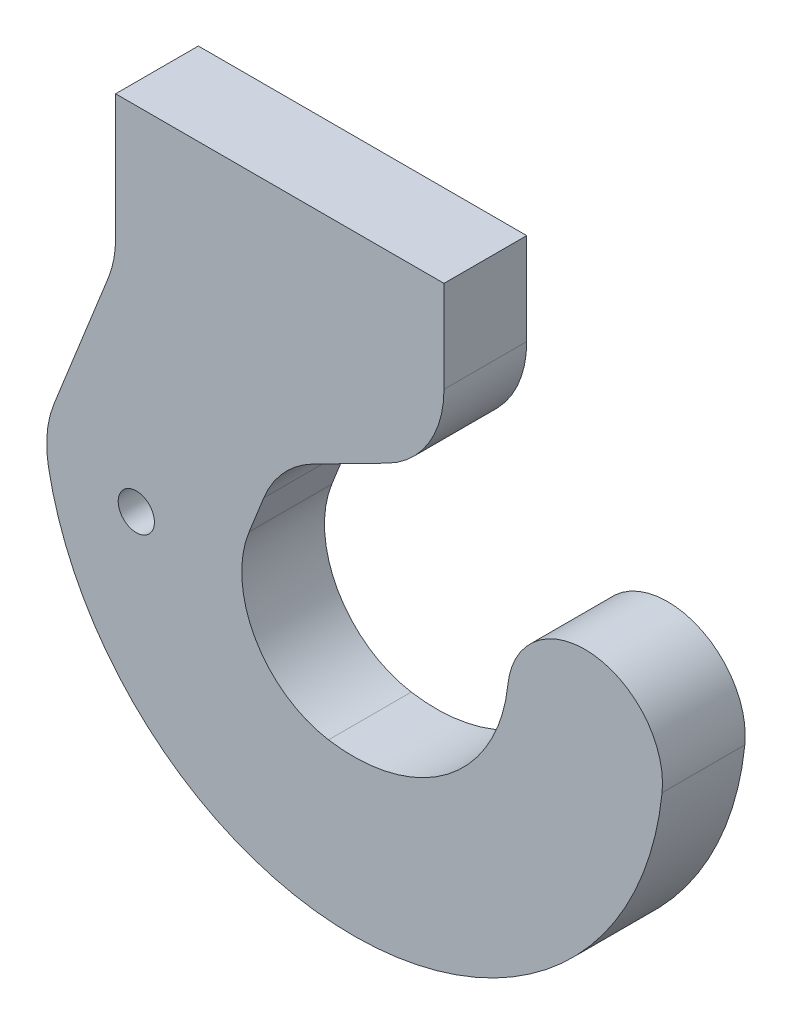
from build123d import *

# Parameters (mm, degrees)
BOSS_EXTRUDE1_DEPTH     = 4
FILLET1_R               = 10
CUT_EXTRUDE1_DEPTH      = 44.090056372
CUT_EXTRUDE1_DEPTH_BACK = 44.090056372
SKETCH3_R               = 1.75


with BuildPart() as part:
    # Sketch2 → Boss-Extrude1 (new, symmetric)
    with BuildSketch(Plane(origin=(0, 0, 5), x_dir=(-1, 0, 0), z_dir=(0, 0, -1))):
        with BuildLine():
            Line((-8.75, 29), (23, 29))
            Line((23, 29), (23, 15))
            Line((23, 15), (29.90933601, -2.330583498))
            ThreePointArc((29.90933601, -2.330583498), (0.390036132, -29.997464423), (-29.838629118, -3.107444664))
            ThreePointArc((-29.838629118, -3.107444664), (-23.155833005, 5.129073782), (-14.919314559, -1.553722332))
            ThreePointArc((-14.919314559, -1.553722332), (-3.352723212, -14.620507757), (12.751621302, -7.899123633))
            Line((12.751621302, -7.899123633), (7.282910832, 5.817960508))
            Line((7.282910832, 5.817960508), (-8.75, 14))
            Line((-8.75, 14), (-8.75, 29))
        make_face()
    extrude(amount=BOSS_EXTRUDE1_DEPTH, both=True)

    # Fillet1
    fillet1_edges = [part.edges().sort_by_distance(p)[0] for p in [
        (-23, 15, 5),
        (-29.90933601, -2.330583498, 5),
        (-12.751621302, -7.899123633, 5),
        (-7.282910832, 5.817960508, 5),
        (8.75, 14, 5),
    ]]
    fillet(fillet1_edges, radius=FILLET1_R)

    # Sketch3 → Cut-Extrude1 (cut, two sides: drawn at the far end of the back side and taken through both)
    with BuildSketch(Plane.XY.offset(9).offset(-CUT_EXTRUDE1_DEPTH_BACK)):
        with Locations((-21, -5)):
            Circle(SKETCH3_R)
    extrude(amount=CUT_EXTRUDE1_DEPTH + CUT_EXTRUDE1_DEPTH_BACK, mode=Mode.SUBTRACT)


solid = part.part
